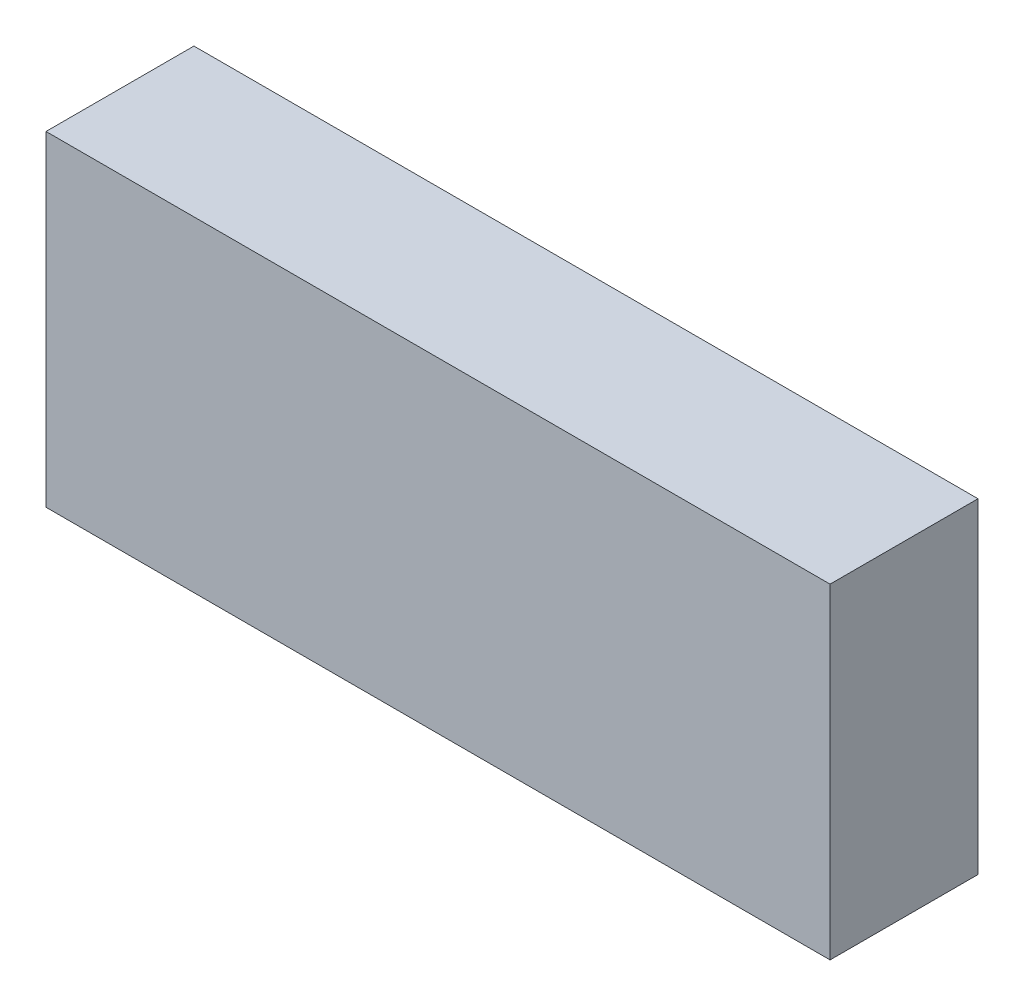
ISO-10303-21;
HEADER;
FILE_DESCRIPTION(('STEP AP214'),'2;1');
FILE_NAME('part.step','',(''),(''),'','','');
FILE_SCHEMA(('AUTOMOTIVE_DESIGN { 1 0 10303 214 1 1 1 1 }'));
ENDSEC;
DATA;
#1=APPLICATION_CONTEXT('core data for automotive mechanical design processes');
#2=APPLICATION_PROTOCOL_DEFINITION('international standard','automotive_design',2000,#1);
#3=PRODUCT_CONTEXT('',#1,'mechanical');
#4=PRODUCT('Part','Part','',(#3));
#5=PRODUCT_RELATED_PRODUCT_CATEGORY('part','',(#4));
#6=PRODUCT_DEFINITION_FORMATION('','',#4);
#7=PRODUCT_DEFINITION_CONTEXT('part definition',#1,'design');
#8=PRODUCT_DEFINITION('design','',#6,#7);
#9=PRODUCT_DEFINITION_SHAPE('','',#8);
#10=(LENGTH_UNIT() NAMED_UNIT(*) SI_UNIT(.MILLI.,.METRE.));
#11=(NAMED_UNIT(*) PLANE_ANGLE_UNIT() SI_UNIT($,.RADIAN.));
#12=(NAMED_UNIT(*) SI_UNIT($,.STERADIAN.) SOLID_ANGLE_UNIT());
#13=UNCERTAINTY_MEASURE_WITH_UNIT(LENGTH_MEASURE(1.E-05),#10,'distance_accuracy_value','');
#14=(GEOMETRIC_REPRESENTATION_CONTEXT(3) GLOBAL_UNCERTAINTY_ASSIGNED_CONTEXT((#13)) GLOBAL_UNIT_ASSIGNED_CONTEXT((#10,
#11,#12)) REPRESENTATION_CONTEXT('',''));
#15=CARTESIAN_POINT('',(0.,0.,0.));
#16=DIRECTION('',(0.,0.,1.));
#17=DIRECTION('',(1.,0.,0.));
#18=AXIS2_PLACEMENT_3D('',#15,#16,#17);
#19=CARTESIAN_POINT('',(0.,0.,5.));
#20=DIRECTION('',(0.,0.,1.));
#21=DIRECTION('',(1.,0.,0.));
#22=AXIS2_PLACEMENT_3D('',#19,#20,#21);
#23=PLANE('',#22);
#24=DIRECTION('',(-1.,0.,0.));
#25=VECTOR('',#24,1.);
#26=CARTESIAN_POINT('',(0.,-11.,5.));
#27=LINE('',#26,#25);
#28=CARTESIAN_POINT('',(26.5,-11.,5.));
#29=VERTEX_POINT('',#28);
#30=CARTESIAN_POINT('',(-26.5,-11.,5.));
#31=VERTEX_POINT('',#30);
#32=EDGE_CURVE('E11',#29,#31,#27,.T.);
#33=ORIENTED_EDGE('',*,*,#32,.F.);
#34=DIRECTION('',(0.,-1.,0.));
#35=VECTOR('',#34,1.);
#36=CARTESIAN_POINT('',(26.5,0.,5.));
#37=LINE('',#36,#35);
#38=CARTESIAN_POINT('',(26.5,11.,5.));
#39=VERTEX_POINT('',#38);
#40=EDGE_CURVE('E61',#39,#29,#37,.T.);
#41=ORIENTED_EDGE('',*,*,#40,.F.);
#42=DIRECTION('',(1.,0.,0.));
#43=VECTOR('',#42,1.);
#44=CARTESIAN_POINT('',(0.,11.,5.));
#45=LINE('',#44,#43);
#46=CARTESIAN_POINT('',(-26.5,11.,5.));
#47=VERTEX_POINT('',#46);
#48=EDGE_CURVE('E87',#47,#39,#45,.T.);
#49=ORIENTED_EDGE('',*,*,#48,.F.);
#50=DIRECTION('',(0.,1.,0.));
#51=VECTOR('',#50,1.);
#52=CARTESIAN_POINT('',(-26.5,0.,5.));
#53=LINE('',#52,#51);
#54=EDGE_CURVE('E24',#31,#47,#53,.T.);
#55=ORIENTED_EDGE('',*,*,#54,.F.);
#56=EDGE_LOOP('',(#33,#41,#49,#55));
#57=FACE_BOUND('',#56,.T.);
#58=ADVANCED_FACE('F17',(#57),#23,.T.);
#59=CARTESIAN_POINT('',(0.,-11.,-5.));
#60=DIRECTION('',(0.,-1.,0.));
#61=DIRECTION('',(0.,0.,-1.));
#62=AXIS2_PLACEMENT_3D('',#59,#60,#61);
#63=PLANE('',#62);
#64=DIRECTION('',(0.,0.,1.));
#65=VECTOR('',#64,1.);
#66=CARTESIAN_POINT('',(26.5,-11.,-5.));
#67=LINE('',#66,#65);
#68=CARTESIAN_POINT('',(26.5,-11.,-5.));
#69=VERTEX_POINT('',#68);
#70=EDGE_CURVE('E53',#69,#29,#67,.T.);
#71=ORIENTED_EDGE('',*,*,#70,.T.);
#72=ORIENTED_EDGE('',*,*,#32,.T.);
#73=DIRECTION('',(0.,0.,1.));
#74=VECTOR('',#73,1.);
#75=CARTESIAN_POINT('',(-26.5,-11.,-5.));
#76=LINE('',#75,#74);
#77=CARTESIAN_POINT('',(-26.5,-11.,-5.));
#78=VERTEX_POINT('',#77);
#79=EDGE_CURVE('E70',#78,#31,#76,.T.);
#80=ORIENTED_EDGE('',*,*,#79,.F.);
#81=DIRECTION('',(1.,0.,0.));
#82=VECTOR('',#81,1.);
#83=CARTESIAN_POINT('',(0.,-11.,-5.));
#84=LINE('',#83,#82);
#85=EDGE_CURVE('E65',#78,#69,#84,.T.);
#86=ORIENTED_EDGE('',*,*,#85,.T.);
#87=EDGE_LOOP('',(#71,#72,#80,#86));
#88=FACE_BOUND('',#87,.T.);
#89=ADVANCED_FACE('F66',(#88),#63,.T.);
#90=CARTESIAN_POINT('',(-26.5,0.,-5.));
#91=DIRECTION('',(-1.,0.,0.));
#92=DIRECTION('',(0.,0.,1.));
#93=AXIS2_PLACEMENT_3D('',#90,#91,#92);
#94=PLANE('',#93);
#95=ORIENTED_EDGE('',*,*,#79,.T.);
#96=ORIENTED_EDGE('',*,*,#54,.T.);
#97=DIRECTION('',(0.,0.,1.));
#98=VECTOR('',#97,1.);
#99=CARTESIAN_POINT('',(-26.5,11.,-5.));
#100=LINE('',#99,#98);
#101=CARTESIAN_POINT('',(-26.5,11.,-5.));
#102=VERTEX_POINT('',#101);
#103=EDGE_CURVE('E85',#102,#47,#100,.T.);
#104=ORIENTED_EDGE('',*,*,#103,.F.);
#105=DIRECTION('',(0.,-1.,0.));
#106=VECTOR('',#105,1.);
#107=CARTESIAN_POINT('',(-26.5,0.,-5.));
#108=LINE('',#107,#106);
#109=EDGE_CURVE('E75',#102,#78,#108,.T.);
#110=ORIENTED_EDGE('',*,*,#109,.T.);
#111=EDGE_LOOP('',(#95,#96,#104,#110));
#112=FACE_BOUND('',#111,.T.);
#113=ADVANCED_FACE('F93',(#112),#94,.T.);
#114=CARTESIAN_POINT('',(0.,11.,-5.));
#115=DIRECTION('',(0.,1.,0.));
#116=DIRECTION('',(0.,0.,1.));
#117=AXIS2_PLACEMENT_3D('',#114,#115,#116);
#118=PLANE('',#117);
#119=ORIENTED_EDGE('',*,*,#103,.T.);
#120=ORIENTED_EDGE('',*,*,#48,.T.);
#121=DIRECTION('',(0.,0.,1.));
#122=VECTOR('',#121,1.);
#123=CARTESIAN_POINT('',(26.5,11.,-5.));
#124=LINE('',#123,#122);
#125=CARTESIAN_POINT('',(26.5,11.,-5.));
#126=VERTEX_POINT('',#125);
#127=EDGE_CURVE('E62',#126,#39,#124,.T.);
#128=ORIENTED_EDGE('',*,*,#127,.F.);
#129=DIRECTION('',(-1.,0.,0.));
#130=VECTOR('',#129,1.);
#131=CARTESIAN_POINT('',(0.,11.,-5.));
#132=LINE('',#131,#130);
#133=EDGE_CURVE('E76',#126,#102,#132,.T.);
#134=ORIENTED_EDGE('',*,*,#133,.T.);
#135=EDGE_LOOP('',(#119,#120,#128,#134));
#136=FACE_BOUND('',#135,.T.);
#137=ADVANCED_FACE('F90',(#136),#118,.T.);
#138=CARTESIAN_POINT('',(0.,0.,-5.));
#139=DIRECTION('',(0.,0.,-1.));
#140=DIRECTION('',(-1.,0.,0.));
#141=AXIS2_PLACEMENT_3D('',#138,#139,#140);
#142=PLANE('',#141);
#143=DIRECTION('',(0.,1.,0.));
#144=VECTOR('',#143,1.);
#145=CARTESIAN_POINT('',(26.5,0.,-5.));
#146=LINE('',#145,#144);
#147=EDGE_CURVE('E56',#69,#126,#146,.T.);
#148=ORIENTED_EDGE('',*,*,#147,.F.);
#149=ORIENTED_EDGE('',*,*,#85,.F.);
#150=ORIENTED_EDGE('',*,*,#109,.F.);
#151=ORIENTED_EDGE('',*,*,#133,.F.);
#152=EDGE_LOOP('',(#148,#149,#150,#151));
#153=FACE_BOUND('',#152,.T.);
#154=ADVANCED_FACE('F72',(#153),#142,.T.);
#155=CARTESIAN_POINT('',(26.5,0.,-5.));
#156=DIRECTION('',(1.,0.,0.));
#157=DIRECTION('',(0.,0.,-1.));
#158=AXIS2_PLACEMENT_3D('',#155,#156,#157);
#159=PLANE('',#158);
#160=ORIENTED_EDGE('',*,*,#147,.T.);
#161=ORIENTED_EDGE('',*,*,#127,.T.);
#162=ORIENTED_EDGE('',*,*,#40,.T.);
#163=ORIENTED_EDGE('',*,*,#70,.F.);
#164=EDGE_LOOP('',(#160,#161,#162,#163));
#165=FACE_BOUND('',#164,.T.);
#166=ADVANCED_FACE('F57',(#165),#159,.T.);
#167=CLOSED_SHELL('',(#58,#89,#113,#137,#154,#166));
#168=MANIFOLD_SOLID_BREP('B1',#167);
#169=ADVANCED_BREP_SHAPE_REPRESENTATION('',(#18,#168),#14);
#170=SHAPE_DEFINITION_REPRESENTATION(#9,#169);
ENDSEC;
END-ISO-10303-21;
